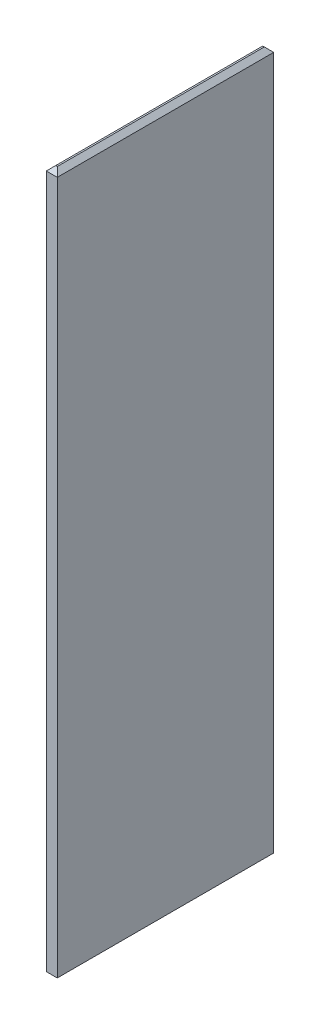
ISO-10303-21;
HEADER;
FILE_DESCRIPTION(('STEP AP214'),'2;1');
FILE_NAME('part.step','',(''),(''),'','','');
FILE_SCHEMA(('AUTOMOTIVE_DESIGN { 1 0 10303 214 1 1 1 1 }'));
ENDSEC;
DATA;
#1=APPLICATION_CONTEXT('core data for automotive mechanical design processes');
#2=APPLICATION_PROTOCOL_DEFINITION('international standard','automotive_design',2000,#1);
#3=PRODUCT_CONTEXT('',#1,'mechanical');
#4=PRODUCT('Part','Part','',(#3));
#5=PRODUCT_RELATED_PRODUCT_CATEGORY('part','',(#4));
#6=PRODUCT_DEFINITION_FORMATION('','',#4);
#7=PRODUCT_DEFINITION_CONTEXT('part definition',#1,'design');
#8=PRODUCT_DEFINITION('design','',#6,#7);
#9=PRODUCT_DEFINITION_SHAPE('','',#8);
#10=(LENGTH_UNIT() NAMED_UNIT(*) SI_UNIT(.MILLI.,.METRE.));
#11=(NAMED_UNIT(*) PLANE_ANGLE_UNIT() SI_UNIT($,.RADIAN.));
#12=(NAMED_UNIT(*) SI_UNIT($,.STERADIAN.) SOLID_ANGLE_UNIT());
#13=UNCERTAINTY_MEASURE_WITH_UNIT(LENGTH_MEASURE(1.E-05),#10,'distance_accuracy_value','');
#14=(GEOMETRIC_REPRESENTATION_CONTEXT(3) GLOBAL_UNCERTAINTY_ASSIGNED_CONTEXT((#13)) GLOBAL_UNIT_ASSIGNED_CONTEXT((#10,
#11,#12)) REPRESENTATION_CONTEXT('',''));
#15=CARTESIAN_POINT('',(0.,0.,0.));
#16=DIRECTION('',(0.,0.,1.));
#17=DIRECTION('',(1.,0.,0.));
#18=AXIS2_PLACEMENT_3D('',#15,#16,#17);
#19=CARTESIAN_POINT('',(-76.2000000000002,9739.6,1500.));
#20=DIRECTION('',(1.,0.,0.));
#21=DIRECTION('',(0.,0.,-1.));
#22=AXIS2_PLACEMENT_3D('',#19,#20,#21);
#23=PLANE('',#22);
#24=DIRECTION('',(0.,-1.,0.));
#25=VECTOR('',#24,1.);
#26=CARTESIAN_POINT('',(-76.2000000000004,9739.6,-1500.));
#27=LINE('',#26,#25);
#28=CARTESIAN_POINT('',(-76.2000000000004,9674.6,-1500.));
#29=VERTEX_POINT('',#28);
#30=CARTESIAN_POINT('',(-76.2000000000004,64.9999999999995,-1500.));
#31=VERTEX_POINT('',#30);
#32=EDGE_CURVE('E170',#29,#31,#27,.T.);
#33=ORIENTED_EDGE('',*,*,#32,.T.);
#34=DIRECTION('',(0.,0.,1.));
#35=VECTOR('',#34,1.);
#36=CARTESIAN_POINT('',(-76.2000000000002,64.9999999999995,1500.));
#37=LINE('',#36,#35);
#38=CARTESIAN_POINT('',(-76.2000000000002,64.9999999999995,1500.));
#39=VERTEX_POINT('',#38);
#40=EDGE_CURVE('E182',#31,#39,#37,.T.);
#41=ORIENTED_EDGE('',*,*,#40,.T.);
#42=DIRECTION('',(0.,-1.,0.));
#43=VECTOR('',#42,1.);
#44=CARTESIAN_POINT('',(-76.2000000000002,9739.6,1500.));
#45=LINE('',#44,#43);
#46=CARTESIAN_POINT('',(-76.2000000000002,9674.6,1500.));
#47=VERTEX_POINT('',#46);
#48=EDGE_CURVE('E140',#47,#39,#45,.T.);
#49=ORIENTED_EDGE('',*,*,#48,.F.);
#50=DIRECTION('',(0.,0.,-1.));
#51=VECTOR('',#50,1.);
#52=CARTESIAN_POINT('',(-76.2000000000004,9674.6,-1500.));
#53=LINE('',#52,#51);
#54=EDGE_CURVE('E184',#47,#29,#53,.T.);
#55=ORIENTED_EDGE('',*,*,#54,.T.);
#56=EDGE_LOOP('',(#33,#41,#49,#55));
#57=FACE_BOUND('',#56,.T.);
#58=ADVANCED_FACE('F50',(#57),#23,.F.);
#59=CARTESIAN_POINT('',(76.1999999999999,9739.6,1500.));
#60=DIRECTION('',(0.,0.,-1.));
#61=DIRECTION('',(-1.,0.,0.));
#62=AXIS2_PLACEMENT_3D('',#59,#60,#61);
#63=PLANE('',#62);
#64=ORIENTED_EDGE('',*,*,#48,.T.);
#65=DIRECTION('',(1.,0.,0.));
#66=VECTOR('',#65,1.);
#67=CARTESIAN_POINT('',(76.1999999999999,64.9999999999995,1500.));
#68=LINE('',#67,#66);
#69=CARTESIAN_POINT('',(76.1999999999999,64.9999999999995,1500.));
#70=VERTEX_POINT('',#69);
#71=EDGE_CURVE('E139',#39,#70,#68,.T.);
#72=ORIENTED_EDGE('',*,*,#71,.T.);
#73=DIRECTION('',(0.,-1.,0.));
#74=VECTOR('',#73,1.);
#75=CARTESIAN_POINT('',(76.1999999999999,9739.6,1500.));
#76=LINE('',#75,#74);
#77=CARTESIAN_POINT('',(76.1999999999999,9674.6,1500.));
#78=VERTEX_POINT('',#77);
#79=EDGE_CURVE('E120',#78,#70,#76,.T.);
#80=ORIENTED_EDGE('',*,*,#79,.F.);
#81=DIRECTION('',(-1.,0.,0.));
#82=VECTOR('',#81,1.);
#83=CARTESIAN_POINT('',(-76.2000000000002,9674.6,1500.));
#84=LINE('',#83,#82);
#85=EDGE_CURVE('E135',#78,#47,#84,.T.);
#86=ORIENTED_EDGE('',*,*,#85,.T.);
#87=EDGE_LOOP('',(#64,#72,#80,#86));
#88=FACE_BOUND('',#87,.T.);
#89=ADVANCED_FACE('F134',(#88),#63,.F.);
#90=CARTESIAN_POINT('',(76.1999999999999,9739.6,1500.));
#91=DIRECTION('',(-1.,0.,0.));
#92=DIRECTION('',(0.,0.,1.));
#93=AXIS2_PLACEMENT_3D('',#90,#91,#92);
#94=PLANE('',#93);
#95=ORIENTED_EDGE('',*,*,#79,.T.);
#96=DIRECTION('',(0.,0.,-1.));
#97=VECTOR('',#96,1.);
#98=CARTESIAN_POINT('',(76.1999999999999,64.9999999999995,1500.));
#99=LINE('',#98,#97);
#100=CARTESIAN_POINT('',(76.1999999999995,64.9999999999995,-1500.));
#101=VERTEX_POINT('',#100);
#102=EDGE_CURVE('E122',#70,#101,#99,.T.);
#103=ORIENTED_EDGE('',*,*,#102,.T.);
#104=DIRECTION('',(0.,-1.,0.));
#105=VECTOR('',#104,1.);
#106=CARTESIAN_POINT('',(76.1999999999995,9739.6,-1500.));
#107=LINE('',#106,#105);
#108=CARTESIAN_POINT('',(76.1999999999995,9674.6,-1500.));
#109=VERTEX_POINT('',#108);
#110=EDGE_CURVE('E118',#109,#101,#107,.T.);
#111=ORIENTED_EDGE('',*,*,#110,.F.);
#112=DIRECTION('',(0.,0.,1.));
#113=VECTOR('',#112,1.);
#114=CARTESIAN_POINT('',(76.1999999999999,9674.6,1500.));
#115=LINE('',#114,#113);
#116=EDGE_CURVE('E113',#109,#78,#115,.T.);
#117=ORIENTED_EDGE('',*,*,#116,.T.);
#118=EDGE_LOOP('',(#95,#103,#111,#117));
#119=FACE_BOUND('',#118,.T.);
#120=ADVANCED_FACE('F119',(#119),#94,.F.);
#121=CARTESIAN_POINT('',(76.1999999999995,9739.6,-1500.));
#122=DIRECTION('',(0.,0.,1.));
#123=DIRECTION('',(1.,0.,0.));
#124=AXIS2_PLACEMENT_3D('',#121,#122,#123);
#125=PLANE('',#124);
#126=ORIENTED_EDGE('',*,*,#110,.T.);
#127=DIRECTION('',(-1.,0.,0.));
#128=VECTOR('',#127,1.);
#129=CARTESIAN_POINT('',(76.1999999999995,64.9999999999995,-1500.));
#130=LINE('',#129,#128);
#131=EDGE_CURVE('E189',#101,#31,#130,.T.);
#132=ORIENTED_EDGE('',*,*,#131,.T.);
#133=ORIENTED_EDGE('',*,*,#32,.F.);
#134=DIRECTION('',(1.,0.,0.));
#135=VECTOR('',#134,1.);
#136=CARTESIAN_POINT('',(76.1999999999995,9674.6,-1500.));
#137=LINE('',#136,#135);
#138=EDGE_CURVE('E188',#29,#109,#137,.T.);
#139=ORIENTED_EDGE('',*,*,#138,.T.);
#140=EDGE_LOOP('',(#126,#132,#133,#139));
#141=FACE_BOUND('',#140,.T.);
#142=ADVANCED_FACE('F236',(#141),#125,.F.);
#143=CARTESIAN_POINT('',(0.,9739.6,0.));
#144=DIRECTION('',(0.,1.,0.));
#145=DIRECTION('',(0.,0.,1.));
#146=AXIS2_PLACEMENT_3D('',#143,#144,#145);
#147=PLANE('',#146);
#148=DIRECTION('',(0.,0.,-1.));
#149=VECTOR('',#148,1.);
#150=CARTESIAN_POINT('',(11.2,9739.6,-1500.));
#151=LINE('',#150,#149);
#152=CARTESIAN_POINT('',(11.2000000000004,9739.6,1435.));
#153=VERTEX_POINT('',#152);
#154=CARTESIAN_POINT('',(11.2,9739.6,-1435.));
#155=VERTEX_POINT('',#154);
#156=EDGE_CURVE('E59',#153,#155,#151,.T.);
#157=ORIENTED_EDGE('',*,*,#156,.T.);
#158=DIRECTION('',(-1.,0.,0.));
#159=VECTOR('',#158,1.);
#160=CARTESIAN_POINT('',(-76.2000000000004,9739.6,-1435.));
#161=LINE('',#160,#159);
#162=CARTESIAN_POINT('',(-11.2000000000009,9739.6,-1435.));
#163=VERTEX_POINT('',#162);
#164=EDGE_CURVE('E11',#155,#163,#161,.T.);
#165=ORIENTED_EDGE('',*,*,#164,.T.);
#166=DIRECTION('',(0.,0.,1.));
#167=VECTOR('',#166,1.);
#168=CARTESIAN_POINT('',(-11.2000000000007,9739.6,1500.));
#169=LINE('',#168,#167);
#170=CARTESIAN_POINT('',(-11.2000000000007,9739.6,1435.));
#171=VERTEX_POINT('',#170);
#172=EDGE_CURVE('E180',#163,#171,#169,.T.);
#173=ORIENTED_EDGE('',*,*,#172,.T.);
#174=DIRECTION('',(1.,0.,0.));
#175=VECTOR('',#174,1.);
#176=CARTESIAN_POINT('',(76.1999999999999,9739.6,1435.));
#177=LINE('',#176,#175);
#178=EDGE_CURVE('E68',#171,#153,#177,.T.);
#179=ORIENTED_EDGE('',*,*,#178,.T.);
#180=EDGE_LOOP('',(#157,#165,#173,#179));
#181=FACE_BOUND('',#180,.T.);
#182=ADVANCED_FACE('F241',(#181),#147,.T.);
#183=CARTESIAN_POINT('',(0.,0.,0.));
#184=DIRECTION('',(0.,1.,0.));
#185=DIRECTION('',(0.,0.,1.));
#186=AXIS2_PLACEMENT_3D('',#183,#184,#185);
#187=PLANE('',#186);
#188=DIRECTION('',(0.,0.,1.));
#189=VECTOR('',#188,1.);
#190=CARTESIAN_POINT('',(11.2000000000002,0.,0.));
#191=LINE('',#190,#189);
#192=CARTESIAN_POINT('',(11.2,0.,-1435.));
#193=VERTEX_POINT('',#192);
#194=CARTESIAN_POINT('',(11.2000000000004,0.,1435.));
#195=VERTEX_POINT('',#194);
#196=EDGE_CURVE('E196',#193,#195,#191,.T.);
#197=ORIENTED_EDGE('',*,*,#196,.T.);
#198=DIRECTION('',(-1.,0.,0.));
#199=VECTOR('',#198,1.);
#200=CARTESIAN_POINT('',(0.,0.,1435.));
#201=LINE('',#200,#199);
#202=CARTESIAN_POINT('',(-11.2000000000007,0.,1435.));
#203=VERTEX_POINT('',#202);
#204=EDGE_CURVE('E127',#195,#203,#201,.T.);
#205=ORIENTED_EDGE('',*,*,#204,.T.);
#206=DIRECTION('',(0.,0.,-1.));
#207=VECTOR('',#206,1.);
#208=CARTESIAN_POINT('',(-11.2000000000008,0.,0.));
#209=LINE('',#208,#207);
#210=CARTESIAN_POINT('',(-11.2000000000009,0.,-1435.));
#211=VERTEX_POINT('',#210);
#212=EDGE_CURVE('E204',#203,#211,#209,.T.);
#213=ORIENTED_EDGE('',*,*,#212,.T.);
#214=DIRECTION('',(1.,0.,0.));
#215=VECTOR('',#214,1.);
#216=CARTESIAN_POINT('',(0.,0.,-1435.));
#217=LINE('',#216,#215);
#218=EDGE_CURVE('E203',#211,#193,#217,.T.);
#219=ORIENTED_EDGE('',*,*,#218,.T.);
#220=EDGE_LOOP('',(#197,#205,#213,#219));
#221=FACE_BOUND('',#220,.T.);
#222=ADVANCED_FACE('F249',(#221),#187,.F.);
#223=CARTESIAN_POINT('',(76.1999999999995,64.9999999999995,-1500.));
#224=DIRECTION('',(0.,0.707106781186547,0.707106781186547));
#225=DIRECTION('',(-1.,0.,0.));
#226=AXIS2_PLACEMENT_3D('',#223,#224,#225);
#227=PLANE('',#226);
#228=DIRECTION('',(-0.577350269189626,-0.577350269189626,0.577350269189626));
#229=VECTOR('',#228,1.);
#230=CARTESIAN_POINT('',(76.1999999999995,64.9999999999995,-1500.));
#231=LINE('',#230,#229);
#232=EDGE_CURVE('E169',#193,#101,#231,.F.);
#233=ORIENTED_EDGE('',*,*,#232,.F.);
#234=ORIENTED_EDGE('',*,*,#218,.F.);
#235=DIRECTION('',(0.577350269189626,-0.577350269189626,0.577350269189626));
#236=VECTOR('',#235,1.);
#237=CARTESIAN_POINT('',(923.8,-935.,-499.999999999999));
#238=LINE('',#237,#236);
#239=EDGE_CURVE('E162',#31,#211,#238,.T.);
#240=ORIENTED_EDGE('',*,*,#239,.F.);
#241=ORIENTED_EDGE('',*,*,#131,.F.);
#242=EDGE_LOOP('',(#233,#234,#240,#241));
#243=FACE_BOUND('',#242,.T.);
#244=ADVANCED_FACE('F223',(#243),#227,.F.);
#245=CARTESIAN_POINT('',(-76.2000000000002,64.9999999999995,1500.));
#246=DIRECTION('',(0.707106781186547,0.707106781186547,0.));
#247=DIRECTION('',(0.,0.,1.));
#248=AXIS2_PLACEMENT_3D('',#245,#246,#247);
#249=PLANE('',#248);
#250=ORIENTED_EDGE('',*,*,#239,.T.);
#251=ORIENTED_EDGE('',*,*,#212,.F.);
#252=DIRECTION('',(-0.577350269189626,0.577350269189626,0.577350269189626));
#253=VECTOR('',#252,1.);
#254=CARTESIAN_POINT('',(-76.2000000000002,64.9999999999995,1500.));
#255=LINE('',#254,#253);
#256=EDGE_CURVE('E155',#39,#203,#255,.F.);
#257=ORIENTED_EDGE('',*,*,#256,.F.);
#258=ORIENTED_EDGE('',*,*,#40,.F.);
#259=EDGE_LOOP('',(#250,#251,#257,#258));
#260=FACE_BOUND('',#259,.T.);
#261=ADVANCED_FACE('F226',(#260),#249,.F.);
#262=CARTESIAN_POINT('',(76.1999999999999,64.9999999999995,1500.));
#263=DIRECTION('',(-0.707106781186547,0.707106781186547,0.));
#264=DIRECTION('',(0.,0.,-1.));
#265=AXIS2_PLACEMENT_3D('',#262,#263,#264);
#266=PLANE('',#265);
#267=ORIENTED_EDGE('',*,*,#232,.T.);
#268=ORIENTED_EDGE('',*,*,#102,.F.);
#269=DIRECTION('',(-0.577350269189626,-0.577350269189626,-0.577350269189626));
#270=VECTOR('',#269,1.);
#271=CARTESIAN_POINT('',(76.1999999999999,64.9999999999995,1500.));
#272=LINE('',#271,#270);
#273=EDGE_CURVE('E149',#195,#70,#272,.F.);
#274=ORIENTED_EDGE('',*,*,#273,.F.);
#275=ORIENTED_EDGE('',*,*,#196,.F.);
#276=EDGE_LOOP('',(#267,#268,#274,#275));
#277=FACE_BOUND('',#276,.T.);
#278=ADVANCED_FACE('F240',(#277),#266,.F.);
#279=CARTESIAN_POINT('',(76.1999999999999,64.9999999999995,1500.));
#280=DIRECTION('',(0.,0.707106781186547,-0.707106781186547));
#281=DIRECTION('',(1.,0.,0.));
#282=AXIS2_PLACEMENT_3D('',#279,#280,#281);
#283=PLANE('',#282);
#284=ORIENTED_EDGE('',*,*,#256,.T.);
#285=ORIENTED_EDGE('',*,*,#204,.F.);
#286=ORIENTED_EDGE('',*,*,#273,.T.);
#287=ORIENTED_EDGE('',*,*,#71,.F.);
#288=EDGE_LOOP('',(#284,#285,#286,#287));
#289=FACE_BOUND('',#288,.T.);
#290=ADVANCED_FACE('F231',(#289),#283,.F.);
#291=CARTESIAN_POINT('',(0.,9739.6,1435.));
#292=DIRECTION('',(0.,0.707106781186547,0.707106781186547));
#293=DIRECTION('',(-1.,0.,0.));
#294=AXIS2_PLACEMENT_3D('',#291,#292,#293);
#295=PLANE('',#294);
#296=DIRECTION('',(0.577350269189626,0.577350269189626,-0.577350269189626));
#297=VECTOR('',#296,1.);
#298=CARTESIAN_POINT('',(467.133333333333,10217.9333333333,956.666666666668));
#299=LINE('',#298,#297);
#300=EDGE_CURVE('E141',#47,#171,#299,.T.);
#301=ORIENTED_EDGE('',*,*,#300,.F.);
#302=ORIENTED_EDGE('',*,*,#85,.F.);
#303=DIRECTION('',(-0.577350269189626,0.577350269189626,-0.577350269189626));
#304=VECTOR('',#303,1.);
#305=CARTESIAN_POINT('',(7.46666666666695,9743.33333333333,1431.26666666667));
#306=LINE('',#305,#304);
#307=EDGE_CURVE('E55',#153,#78,#306,.F.);
#308=ORIENTED_EDGE('',*,*,#307,.F.);
#309=ORIENTED_EDGE('',*,*,#178,.F.);
#310=EDGE_LOOP('',(#301,#302,#308,#309));
#311=FACE_BOUND('',#310,.T.);
#312=ADVANCED_FACE('F49',(#311),#295,.T.);
#313=CARTESIAN_POINT('',(11.2000000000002,9739.6,0.));
#314=DIRECTION('',(0.707106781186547,0.707106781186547,0.));
#315=DIRECTION('',(0.,0.,1.));
#316=AXIS2_PLACEMENT_3D('',#313,#314,#315);
#317=PLANE('',#316);
#318=ORIENTED_EDGE('',*,*,#307,.T.);
#319=ORIENTED_EDGE('',*,*,#116,.F.);
#320=DIRECTION('',(-0.577350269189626,0.577350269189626,0.577350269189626));
#321=VECTOR('',#320,1.);
#322=CARTESIAN_POINT('',(-467.133333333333,10217.9333333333,-956.666666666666));
#323=LINE('',#322,#321);
#324=EDGE_CURVE('E152',#155,#109,#323,.F.);
#325=ORIENTED_EDGE('',*,*,#324,.F.);
#326=ORIENTED_EDGE('',*,*,#156,.F.);
#327=EDGE_LOOP('',(#318,#319,#325,#326));
#328=FACE_BOUND('',#327,.T.);
#329=ADVANCED_FACE('F150',(#328),#317,.T.);
#330=CARTESIAN_POINT('',(-11.2000000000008,9739.6,0.));
#331=DIRECTION('',(-0.707106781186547,0.707106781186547,0.));
#332=DIRECTION('',(0.,0.,-1.));
#333=AXIS2_PLACEMENT_3D('',#330,#331,#332);
#334=PLANE('',#333);
#335=ORIENTED_EDGE('',*,*,#300,.T.);
#336=ORIENTED_EDGE('',*,*,#172,.F.);
#337=DIRECTION('',(-0.577350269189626,-0.577350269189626,-0.577350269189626));
#338=VECTOR('',#337,1.);
#339=CARTESIAN_POINT('',(467.133333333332,10217.9333333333,-956.666666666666));
#340=LINE('',#339,#338);
#341=EDGE_CURVE('E158',#29,#163,#340,.F.);
#342=ORIENTED_EDGE('',*,*,#341,.F.);
#343=ORIENTED_EDGE('',*,*,#54,.F.);
#344=EDGE_LOOP('',(#335,#336,#342,#343));
#345=FACE_BOUND('',#344,.T.);
#346=ADVANCED_FACE('F245',(#345),#334,.T.);
#347=CARTESIAN_POINT('',(0.,9739.6,-1435.));
#348=DIRECTION('',(0.,0.707106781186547,-0.707106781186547));
#349=DIRECTION('',(1.,0.,0.));
#350=AXIS2_PLACEMENT_3D('',#347,#348,#349);
#351=PLANE('',#350);
#352=ORIENTED_EDGE('',*,*,#324,.T.);
#353=ORIENTED_EDGE('',*,*,#138,.F.);
#354=ORIENTED_EDGE('',*,*,#341,.T.);
#355=ORIENTED_EDGE('',*,*,#164,.F.);
#356=EDGE_LOOP('',(#352,#353,#354,#355));
#357=FACE_BOUND('',#356,.T.);
#358=ADVANCED_FACE('F242',(#357),#351,.T.);
#359=CLOSED_SHELL('',(#58,#89,#120,#142,#182,#222,#244,#261,#278,#290,#312,#329,#346,#358));
#360=MANIFOLD_SOLID_BREP('B2',#359);
#361=ADVANCED_BREP_SHAPE_REPRESENTATION('',(#18,#360),#14);
#362=SHAPE_DEFINITION_REPRESENTATION(#9,#361);
ENDSEC;
END-ISO-10303-21;
